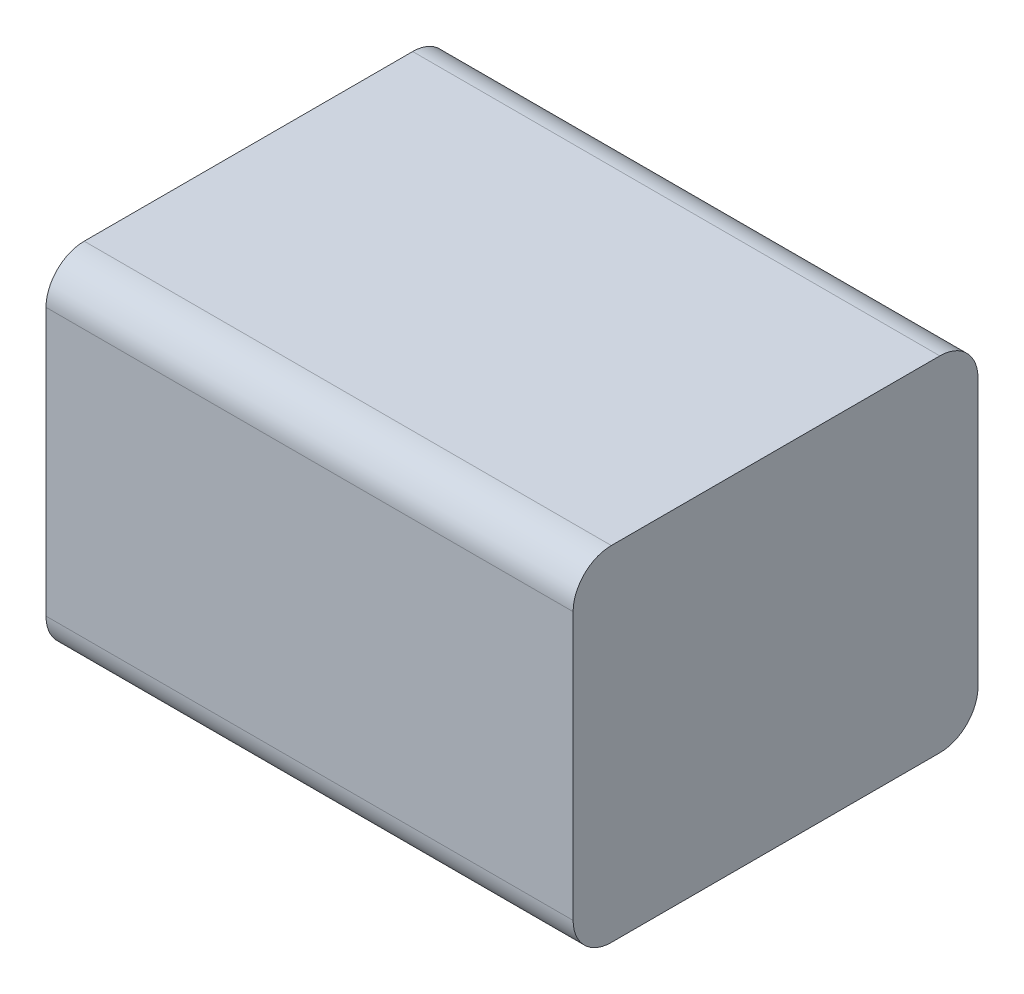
from build123d import *

# Parameters (mm, degrees)
SKETCH1_W           = 53
SKETCH1_H           = 45
BOSS_EXTRUDE1_DEPTH = 69
FILLET1_R           = 5
SCALE1_SCALE        = 0.7


with BuildPart() as part:
    # Sketch1 → Boss-Extrude1 (new body)
    with BuildSketch(Plane(origin=(0, 0, 0), x_dir=(0, 0, -1), z_dir=(1, 0, 0))):
        Rectangle(SKETCH1_W, SKETCH1_H)
    extrude(amount=BOSS_EXTRUDE1_DEPTH)

    # Fillet1
    fillet1_edges = [part.edges().sort_by_distance(p)[0] for p in [
        (34.5, -22.5, -26.5),
        (34.5, -22.5, 26.5),
        (34.5, 22.5, 26.5),
        (34.5, 22.5, -26.5),
    ]]
    fillet(fillet1_edges, radius=FILLET1_R)


with BuildPart() as part_1:
    # Scale1: scaled about (34.5, 0, 0)
    add(part.part.scale(SCALE1_SCALE).moved(Location((10.35, 0, 0))))


solid = part_1.part
